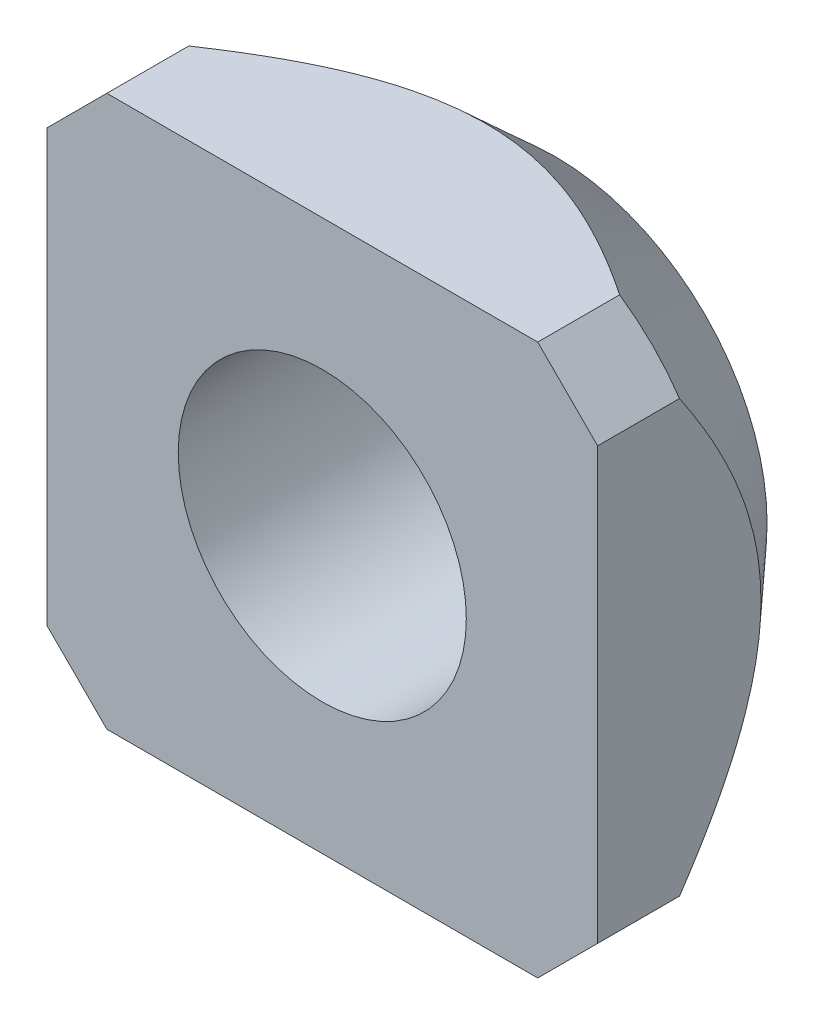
ISO-10303-21;
HEADER;
FILE_DESCRIPTION(('STEP AP214'),'2;1');
FILE_NAME('part.step','',(''),(''),'','','');
FILE_SCHEMA(('AUTOMOTIVE_DESIGN { 1 0 10303 214 1 1 1 1 }'));
ENDSEC;
DATA;
#1=APPLICATION_CONTEXT('core data for automotive mechanical design processes');
#2=APPLICATION_PROTOCOL_DEFINITION('international standard','automotive_design',2000,#1);
#3=PRODUCT_CONTEXT('',#1,'mechanical');
#4=PRODUCT('Part','Part','',(#3));
#5=PRODUCT_RELATED_PRODUCT_CATEGORY('part','',(#4));
#6=PRODUCT_DEFINITION_FORMATION('','',#4);
#7=PRODUCT_DEFINITION_CONTEXT('part definition',#1,'design');
#8=PRODUCT_DEFINITION('design','',#6,#7);
#9=PRODUCT_DEFINITION_SHAPE('','',#8);
#10=(LENGTH_UNIT() NAMED_UNIT(*) SI_UNIT(.MILLI.,.METRE.));
#11=(NAMED_UNIT(*) PLANE_ANGLE_UNIT() SI_UNIT($,.RADIAN.));
#12=(NAMED_UNIT(*) SI_UNIT($,.STERADIAN.) SOLID_ANGLE_UNIT());
#13=UNCERTAINTY_MEASURE_WITH_UNIT(LENGTH_MEASURE(1.E-05),#10,'distance_accuracy_value','');
#14=(GEOMETRIC_REPRESENTATION_CONTEXT(3) GLOBAL_UNCERTAINTY_ASSIGNED_CONTEXT((#13)) GLOBAL_UNIT_ASSIGNED_CONTEXT((#10,
#11,#12)) REPRESENTATION_CONTEXT('',''));
#15=CARTESIAN_POINT('',(0.,0.,0.));
#16=DIRECTION('',(0.,0.,1.));
#17=DIRECTION('',(1.,0.,0.));
#18=AXIS2_PLACEMENT_3D('',#15,#16,#17);
#19=CARTESIAN_POINT('',(0.,0.,-5.5));
#20=DIRECTION('',(0.,0.,1.));
#21=DIRECTION('',(1.,0.,0.));
#22=AXIS2_PLACEMENT_3D('',#19,#20,#21);
#23=PLANE('',#22);
#24=CARTESIAN_POINT('',(0.,0.,-5.5));
#25=DIRECTION('',(0.,0.,1.));
#26=DIRECTION('',(1.,0.,0.));
#27=AXIS2_PLACEMENT_3D('',#24,#25,#26);
#28=CIRCLE('',#27,3.4);
#29=CARTESIAN_POINT('',(3.4,0.,-5.5));
#30=VERTEX_POINT('',#29);
#31=EDGE_CURVE('E248',#30,#30,#28,.T.);
#32=ORIENTED_EDGE('',*,*,#31,.T.);
#33=EDGE_LOOP('',(#32));
#34=FACE_BOUND('',#33,.T.);
#35=CARTESIAN_POINT('',(0.,0.,-5.50000000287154));
#36=DIRECTION('',(0.,0.,1.));
#37=DIRECTION('',(1.,0.,0.));
#38=AXIS2_PLACEMENT_3D('',#35,#36,#37);
#39=CIRCLE('',#38,5.00000000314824);
#40=CARTESIAN_POINT('',(5.00000000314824,0.,-5.50000000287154));
#41=VERTEX_POINT('',#40);
#42=EDGE_CURVE('E35',#41,#41,#39,.T.);
#43=ORIENTED_EDGE('',*,*,#42,.F.);
#44=EDGE_LOOP('',(#43));
#45=FACE_BOUND('',#44,.T.);
#46=ADVANCED_FACE('F32',(#34,#45),#23,.F.);
#47=CARTESIAN_POINT('',(0.,0.,-1.91193420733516));
#48=DIRECTION('',(0.,0.,1.));
#49=DIRECTION('',(1.,0.,0.));
#50=AXIS2_PLACEMENT_3D('',#47,#48,#49);
#51=CONICAL_SURFACE('',#50,8.27271392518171,0.739466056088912);
#52=ORIENTED_EDGE('',*,*,#42,.T.);
#53=EDGE_LOOP('',(#52));
#54=FACE_BOUND('',#53,.T.);
#55=CARTESIAN_POINT('',(-6.49999999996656,5.08578643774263,-1.93333420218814));
#56=CARTESIAN_POINT('',(-6.49999999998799,4.97217656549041,-2.01007902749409));
#57=CARTESIAN_POINT('',(-6.49999999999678,4.85782950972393,-2.08574579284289));
#58=CARTESIAN_POINT('',(-6.50000000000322,4.62749756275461,-2.23459577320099));
#59=CARTESIAN_POINT('',(-6.50000000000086,4.51151233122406,-2.30777846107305));
#60=CARTESIAN_POINT('',(-6.49999999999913,4.27735001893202,-2.45156937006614));
#61=CARTESIAN_POINT('',(-6.49999999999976,4.15916634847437,-2.52216690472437));
#62=CARTESIAN_POINT('',(-6.50000000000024,3.92090179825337,-2.66006146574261));
#63=CARTESIAN_POINT('',(-6.50000000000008,3.80082102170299,-2.72735867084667));
#64=CARTESIAN_POINT('',(-6.49999999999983,3.43117049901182,-2.927024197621));
#65=CARTESIAN_POINT('',(-6.49999999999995,3.17828163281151,-3.05336340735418));
#66=CARTESIAN_POINT('',(-6.50000000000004,2.66320472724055,-3.2847897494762));
#67=CARTESIAN_POINT('',(-6.50000000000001,2.40103115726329,-3.38990837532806));
#68=CARTESIAN_POINT('',(-6.49999999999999,1.96194937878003,-3.54007016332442));
#69=CARTESIAN_POINT('',(-6.5,1.78780916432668,-3.5931930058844));
#70=CARTESIAN_POINT('',(-6.5,1.43593803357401,-3.68604206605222));
#71=CARTESIAN_POINT('',(-6.5,1.25820705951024,-3.72576806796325));
#72=CARTESIAN_POINT('',(-6.5,0.901971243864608,-3.78972854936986));
#73=CARTESIAN_POINT('',(-6.5,0.723496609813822,-3.81412921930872));
#74=CARTESIAN_POINT('',(-6.5,0.365074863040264,-3.84691624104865));
#75=CARTESIAN_POINT('',(-6.5,0.185127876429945,-3.85530395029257));
#76=CARTESIAN_POINT('',(-6.5,-0.175331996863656,-3.85561829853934));
#77=CARTESIAN_POINT('',(-6.5,-0.355844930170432,-3.84749448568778));
#78=CARTESIAN_POINT('',(-6.5,-0.715412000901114,-3.81512247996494));
#79=CARTESIAN_POINT('',(-6.5,-0.894466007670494,-3.79087285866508));
#80=CARTESIAN_POINT('',(-6.5,-1.25186987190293,-3.72710369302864));
#81=CARTESIAN_POINT('',(-6.5,-1.43018938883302,-3.6874161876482));
#82=CARTESIAN_POINT('',(-6.5,-1.7832209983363,-3.59454247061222));
#83=CARTESIAN_POINT('',(-6.5,-1.95793314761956,-3.54135647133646));
#84=CARTESIAN_POINT('',(-6.5,-2.39791270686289,-3.39110767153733));
#85=CARTESIAN_POINT('',(-6.5,-2.66041462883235,-3.2859613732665));
#86=CARTESIAN_POINT('',(-6.5,-3.17612601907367,-3.05441341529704));
#87=CARTESIAN_POINT('',(-6.5,-3.4293209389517,-2.92798006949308));
#88=CARTESIAN_POINT('',(-6.5,-3.79940591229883,-2.72814379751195));
#89=CARTESIAN_POINT('',(-6.5,-3.91962359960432,-2.66078705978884));
#90=CARTESIAN_POINT('',(-6.5,-4.15815744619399,-2.52276484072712));
#91=CARTESIAN_POINT('',(-6.5,-4.27647350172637,-2.45209917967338));
#92=CARTESIAN_POINT('',(-6.5,-4.510894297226,-2.30816632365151));
#93=CARTESIAN_POINT('',(-6.5,-4.62700566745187,-2.23490988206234));
#94=CARTESIAN_POINT('',(-6.5,-4.85758619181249,-2.08590677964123));
#95=CARTESIAN_POINT('',(-6.5,-4.97205568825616,-2.01016064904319));
#96=CARTESIAN_POINT('',(-6.5,-5.08578643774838,-1.93333420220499));
#97=B_SPLINE_CURVE_WITH_KNOTS('',3,(#55,#56,#57,#58,#59,#60,#61,#62,#63,#64,#65,#66,#67,#68,#69,
#70,#71,#72,#73,#74,#75,#76,#77,#78,#79,#80,#81,#82,#83,#84,#85,#86,#87,#88,#89,#90,#91,#92,#93,
#94,#95,#96),.UNSPECIFIED.,.F.,.F.,(4,2,2,2,2,2,2,2,2,2,2,2,2,2,2,2,2,2,2,2,4),(0.,
0.41131042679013,0.822707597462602,1.23564791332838,1.64856583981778,2.49590493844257,
3.34197710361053,3.88772071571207,4.43347311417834,4.97320018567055,5.51288150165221,
6.05421432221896,6.59559510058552,7.1430386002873,7.69047348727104,8.53748456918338,
9.38576777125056,9.79913116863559,10.2125170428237,10.6243522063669,11.0361002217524),.UNSPECIFIED.);
#98=CARTESIAN_POINT('',(-6.50000000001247,5.08578643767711,-1.93333420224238));
#99=VERTEX_POINT('',#98);
#100=CARTESIAN_POINT('',(-6.50000000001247,-5.08578643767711,-1.93333420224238));
#101=VERTEX_POINT('',#100);
#102=EDGE_CURVE('E161',#99,#101,#97,.T.);
#103=ORIENTED_EDGE('',*,*,#102,.F.);
#104=CARTESIAN_POINT('',(-5.08578643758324,6.50000000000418,-1.93333420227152));
#105=CARTESIAN_POINT('',(-5.20320338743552,6.38258305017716,-1.95544496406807));
#106=CARTESIAN_POINT('',(-5.32114245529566,6.26464398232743,-1.97213629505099));
#107=CARTESIAN_POINT('',(-5.55702028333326,6.02876615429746,-1.99438943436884));
#108=CARTESIAN_POINT('',(-5.6749567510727,5.9108296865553,-2.00000000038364));
#109=CARTESIAN_POINT('',(-5.91082968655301,5.67495675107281,-2.00000000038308));
#110=CARTESIAN_POINT('',(-6.02876615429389,5.55702028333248,-1.99438943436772));
#111=CARTESIAN_POINT('',(-6.2646439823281,5.32114245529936,-1.97213629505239));
#112=CARTESIAN_POINT('',(-6.38258305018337,5.20320338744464,-1.95544496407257));
#113=CARTESIAN_POINT('',(-6.50000000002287,5.08578643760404,-1.93333420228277));
#114=B_SPLINE_CURVE_WITH_KNOTS('',3,(#104,#105,#106,#107,#108,#109,#110,#111,#112,#113),
.UNSPECIFIED.,.F.,.F.,(4,2,2,2,4),(0.,0.502492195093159,1.00276834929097,1.50304450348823,
2.00553669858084),.UNSPECIFIED.);
#115=CARTESIAN_POINT('',(-5.08578643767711,6.50000000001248,-1.93333420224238));
#116=VERTEX_POINT('',#115);
#117=EDGE_CURVE('E167',#116,#99,#114,.T.);
#118=ORIENTED_EDGE('',*,*,#117,.F.);
#119=CARTESIAN_POINT('',(5.08578643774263,6.49999999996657,-1.93333420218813));
#120=CARTESIAN_POINT('',(4.9721765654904,6.49999999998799,-2.01007902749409));
#121=CARTESIAN_POINT('',(4.85782950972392,6.49999999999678,-2.08574579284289));
#122=CARTESIAN_POINT('',(4.62749756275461,6.50000000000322,-2.23459577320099));
#123=CARTESIAN_POINT('',(4.51151233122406,6.50000000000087,-2.30777846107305));
#124=CARTESIAN_POINT('',(4.27735001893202,6.49999999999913,-2.45156937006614));
#125=CARTESIAN_POINT('',(4.15916634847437,6.49999999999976,-2.52216690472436));
#126=CARTESIAN_POINT('',(3.92090179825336,6.50000000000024,-2.66006146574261));
#127=CARTESIAN_POINT('',(3.80082102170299,6.50000000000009,-2.72735867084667));
#128=CARTESIAN_POINT('',(3.43117049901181,6.49999999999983,-2.927024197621));
#129=CARTESIAN_POINT('',(3.17828163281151,6.49999999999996,-3.05336340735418));
#130=CARTESIAN_POINT('',(2.66320472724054,6.50000000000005,-3.2847897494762));
#131=CARTESIAN_POINT('',(2.40103115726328,6.50000000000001,-3.38990837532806));
#132=CARTESIAN_POINT('',(1.96194937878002,6.5,-3.54007016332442));
#133=CARTESIAN_POINT('',(1.78780916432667,6.5,-3.5931930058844));
#134=CARTESIAN_POINT('',(1.435938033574,6.50000000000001,-3.68604206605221));
#135=CARTESIAN_POINT('',(1.25820705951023,6.5,-3.72576806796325));
#136=CARTESIAN_POINT('',(0.901971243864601,6.5,-3.78972854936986));
#137=CARTESIAN_POINT('',(0.723496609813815,6.5,-3.81412921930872));
#138=CARTESIAN_POINT('',(0.365074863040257,6.5,-3.84691624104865));
#139=CARTESIAN_POINT('',(0.185127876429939,6.5,-3.85530395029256));
#140=CARTESIAN_POINT('',(-0.175331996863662,6.5,-3.85561829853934));
#141=CARTESIAN_POINT('',(-0.355844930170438,6.5,-3.84749448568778));
#142=CARTESIAN_POINT('',(-0.715412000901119,6.5,-3.81512247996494));
#143=CARTESIAN_POINT('',(-0.8944660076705,6.5,-3.79087285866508));
#144=CARTESIAN_POINT('',(-1.25186987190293,6.5,-3.72710369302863));
#145=CARTESIAN_POINT('',(-1.43018938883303,6.5,-3.68741618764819));
#146=CARTESIAN_POINT('',(-1.7832209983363,6.5,-3.59454247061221));
#147=CARTESIAN_POINT('',(-1.95793314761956,6.5,-3.54135647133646));
#148=CARTESIAN_POINT('',(-2.3979127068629,6.5,-3.39110767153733));
#149=CARTESIAN_POINT('',(-2.66041462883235,6.5,-3.2859613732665));
#150=CARTESIAN_POINT('',(-3.17612601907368,6.5,-3.05441341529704));
#151=CARTESIAN_POINT('',(-3.4293209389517,6.5,-2.92798006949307));
#152=CARTESIAN_POINT('',(-3.79940591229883,6.5,-2.72814379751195));
#153=CARTESIAN_POINT('',(-3.91962359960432,6.5,-2.66078705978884));
#154=CARTESIAN_POINT('',(-4.15815744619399,6.5,-2.52276484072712));
#155=CARTESIAN_POINT('',(-4.27647350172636,6.5,-2.45209917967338));
#156=CARTESIAN_POINT('',(-4.510894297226,6.5,-2.30816632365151));
#157=CARTESIAN_POINT('',(-4.62700566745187,6.5,-2.23490988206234));
#158=CARTESIAN_POINT('',(-4.85758619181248,6.5,-2.08590677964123));
#159=CARTESIAN_POINT('',(-4.97205568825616,6.5,-2.01016064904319));
#160=CARTESIAN_POINT('',(-5.08578643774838,6.5,-1.93333420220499));
#161=B_SPLINE_CURVE_WITH_KNOTS('',3,(#119,#120,#121,#122,#123,#124,#125,#126,#127,#128,#129,
#130,#131,#132,#133,#134,#135,#136,#137,#138,#139,#140,#141,#142,#143,#144,#145,#146,#147,#148,
#149,#150,#151,#152,#153,#154,#155,#156,#157,#158,#159,#160),.UNSPECIFIED.,.F.,.F.,(4,2,2,2,2,2,
2,2,2,2,2,2,2,2,2,2,2,2,2,2,4),(0.,0.411310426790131,0.822707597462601,1.23564791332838,
1.64856583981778,2.49590493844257,3.34197710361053,3.88772071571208,4.43347311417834,
4.97320018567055,5.51288150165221,6.05421432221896,6.59559510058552,7.1430386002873,
7.69047348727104,8.53748456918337,9.38576777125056,9.79913116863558,10.2125170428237,
10.6243522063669,11.0361002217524),.UNSPECIFIED.);
#162=CARTESIAN_POINT('',(5.08578643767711,6.50000000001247,-1.93333420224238));
#163=VERTEX_POINT('',#162);
#164=EDGE_CURVE('E101',#163,#116,#161,.T.);
#165=ORIENTED_EDGE('',*,*,#164,.F.);
#166=CARTESIAN_POINT('',(6.50000000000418,5.08578643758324,-1.93333420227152));
#167=CARTESIAN_POINT('',(6.38258305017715,5.20320338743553,-1.95544496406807));
#168=CARTESIAN_POINT('',(6.26464398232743,5.32114245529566,-1.97213629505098));
#169=CARTESIAN_POINT('',(6.02876615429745,5.55702028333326,-1.99438943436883));
#170=CARTESIAN_POINT('',(5.9108296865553,5.6749567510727,-2.00000000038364));
#171=CARTESIAN_POINT('',(5.67495675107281,5.91082968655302,-2.00000000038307));
#172=CARTESIAN_POINT('',(5.55702028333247,6.02876615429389,-1.99438943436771));
#173=CARTESIAN_POINT('',(5.32114245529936,6.2646439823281,-1.97213629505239));
#174=CARTESIAN_POINT('',(5.20320338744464,6.38258305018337,-1.95544496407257));
#175=CARTESIAN_POINT('',(5.08578643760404,6.50000000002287,-1.93333420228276));
#176=B_SPLINE_CURVE_WITH_KNOTS('',3,(#166,#167,#168,#169,#170,#171,#172,#173,#174,#175),
.UNSPECIFIED.,.F.,.F.,(4,2,2,2,4),(0.,0.502492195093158,1.00276834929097,1.50304450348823,
2.00553669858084),.UNSPECIFIED.);
#177=CARTESIAN_POINT('',(6.50000000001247,5.08578643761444,-1.93333420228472));
#178=VERTEX_POINT('',#177);
#179=EDGE_CURVE('E95',#178,#163,#176,.T.);
#180=ORIENTED_EDGE('',*,*,#179,.F.);
#181=CARTESIAN_POINT('',(6.49999999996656,-5.08578643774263,-1.93333420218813));
#182=CARTESIAN_POINT('',(6.49999999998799,-4.97217656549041,-2.01007902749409));
#183=CARTESIAN_POINT('',(6.49999999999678,-4.85782950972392,-2.08574579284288));
#184=CARTESIAN_POINT('',(6.50000000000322,-4.62749756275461,-2.23459577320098));
#185=CARTESIAN_POINT('',(6.50000000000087,-4.51151233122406,-2.30777846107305));
#186=CARTESIAN_POINT('',(6.49999999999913,-4.27735001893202,-2.45156937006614));
#187=CARTESIAN_POINT('',(6.49999999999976,-4.15916634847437,-2.52216690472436));
#188=CARTESIAN_POINT('',(6.50000000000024,-3.92090179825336,-2.6600614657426));
#189=CARTESIAN_POINT('',(6.50000000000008,-3.80082102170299,-2.72735867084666));
#190=CARTESIAN_POINT('',(6.49999999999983,-3.43117049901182,-2.927024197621));
#191=CARTESIAN_POINT('',(6.49999999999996,-3.17828163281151,-3.05336340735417));
#192=CARTESIAN_POINT('',(6.50000000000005,-2.66320472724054,-3.2847897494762));
#193=CARTESIAN_POINT('',(6.50000000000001,-2.40103115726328,-3.38990837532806));
#194=CARTESIAN_POINT('',(6.49999999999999,-1.96194937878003,-3.54007016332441));
#195=CARTESIAN_POINT('',(6.5,-1.78780916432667,-3.5931930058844));
#196=CARTESIAN_POINT('',(6.5,-1.435938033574,-3.68604206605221));
#197=CARTESIAN_POINT('',(6.5,-1.25820705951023,-3.72576806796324));
#198=CARTESIAN_POINT('',(6.5,-0.901971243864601,-3.78972854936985));
#199=CARTESIAN_POINT('',(6.5,-0.723496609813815,-3.81412921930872));
#200=CARTESIAN_POINT('',(6.5,-0.365074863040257,-3.84691624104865));
#201=CARTESIAN_POINT('',(6.5,-0.185127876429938,-3.85530395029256));
#202=CARTESIAN_POINT('',(6.5,0.175331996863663,-3.85561829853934));
#203=CARTESIAN_POINT('',(6.5,0.355844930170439,-3.84749448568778));
#204=CARTESIAN_POINT('',(6.5,0.715412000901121,-3.81512247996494));
#205=CARTESIAN_POINT('',(6.5,0.894466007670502,-3.79087285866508));
#206=CARTESIAN_POINT('',(6.5,1.25186987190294,-3.72710369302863));
#207=CARTESIAN_POINT('',(6.5,1.43018938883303,-3.68741618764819));
#208=CARTESIAN_POINT('',(6.5,1.7832209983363,-3.59454247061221));
#209=CARTESIAN_POINT('',(6.5,1.95793314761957,-3.54135647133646));
#210=CARTESIAN_POINT('',(6.5,2.3979127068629,-3.39110767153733));
#211=CARTESIAN_POINT('',(6.5,2.66041462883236,-3.2859613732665));
#212=CARTESIAN_POINT('',(6.5,3.17612601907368,-3.05441341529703));
#213=CARTESIAN_POINT('',(6.5,3.42932093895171,-2.92798006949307));
#214=CARTESIAN_POINT('',(6.5,3.79940591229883,-2.72814379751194));
#215=CARTESIAN_POINT('',(6.5,3.91962359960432,-2.66078705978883));
#216=CARTESIAN_POINT('',(6.5,4.15815744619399,-2.52276484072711));
#217=CARTESIAN_POINT('',(6.5,4.27647350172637,-2.45209917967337));
#218=CARTESIAN_POINT('',(6.5,4.51089429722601,-2.30816632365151));
#219=CARTESIAN_POINT('',(6.5,4.62700566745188,-2.23490988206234));
#220=CARTESIAN_POINT('',(6.5,4.85758619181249,-2.08590677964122));
#221=CARTESIAN_POINT('',(6.5,4.97205568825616,-2.01016064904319));
#222=CARTESIAN_POINT('',(6.5,5.08578643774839,-1.93333420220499));
#223=B_SPLINE_CURVE_WITH_KNOTS('',3,(#181,#182,#183,#184,#185,#186,#187,#188,#189,#190,#191,
#192,#193,#194,#195,#196,#197,#198,#199,#200,#201,#202,#203,#204,#205,#206,#207,#208,#209,#210,
#211,#212,#213,#214,#215,#216,#217,#218,#219,#220,#221,#222),.UNSPECIFIED.,.F.,.F.,(4,2,2,2,2,2,
2,2,2,2,2,2,2,2,2,2,2,2,2,2,4),(0.,0.411310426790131,0.822707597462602,1.23564791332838,
1.64856583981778,2.49590493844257,3.34197710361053,3.88772071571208,4.43347311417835,
4.97320018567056,5.51288150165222,6.05421432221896,6.59559510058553,7.14303860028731,
7.69047348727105,8.53748456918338,9.38576777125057,9.79913116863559,10.2125170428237,
10.6243522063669,11.0361002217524),.UNSPECIFIED.);
#224=CARTESIAN_POINT('',(6.50000000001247,-5.08578643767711,-1.93333420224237));
#225=VERTEX_POINT('',#224);
#226=EDGE_CURVE('E99',#225,#178,#223,.T.);
#227=ORIENTED_EDGE('',*,*,#226,.F.);
#228=CARTESIAN_POINT('',(5.08578643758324,-6.50000000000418,-1.93333420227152));
#229=CARTESIAN_POINT('',(5.20320338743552,-6.38258305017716,-1.95544496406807));
#230=CARTESIAN_POINT('',(5.32114245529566,-6.26464398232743,-1.97213629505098));
#231=CARTESIAN_POINT('',(5.55702028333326,-6.02876615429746,-1.99438943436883));
#232=CARTESIAN_POINT('',(5.6749567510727,-5.9108296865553,-2.00000000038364));
#233=CARTESIAN_POINT('',(5.91082968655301,-5.67495675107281,-2.00000000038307));
#234=CARTESIAN_POINT('',(6.02876615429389,-5.55702028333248,-1.99438943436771));
#235=CARTESIAN_POINT('',(6.2646439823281,-5.32114245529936,-1.97213629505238));
#236=CARTESIAN_POINT('',(6.38258305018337,-5.20320338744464,-1.95544496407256));
#237=CARTESIAN_POINT('',(6.50000000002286,-5.08578643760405,-1.93333420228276));
#238=B_SPLINE_CURVE_WITH_KNOTS('',3,(#228,#229,#230,#231,#232,#233,#234,#235,#236,#237),
.UNSPECIFIED.,.F.,.F.,(4,2,2,2,4),(0.,0.502492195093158,1.00276834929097,1.50304450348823,
2.00553669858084),.UNSPECIFIED.);
#239=CARTESIAN_POINT('',(5.08578643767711,-6.50000000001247,-1.93333420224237));
#240=VERTEX_POINT('',#239);
#241=EDGE_CURVE('E115',#240,#225,#238,.T.);
#242=ORIENTED_EDGE('',*,*,#241,.F.);
#243=CARTESIAN_POINT('',(-5.08578643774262,-6.49999999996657,-1.93333420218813));
#244=CARTESIAN_POINT('',(-4.9721765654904,-6.49999999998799,-2.01007902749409));
#245=CARTESIAN_POINT('',(-4.85782950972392,-6.49999999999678,-2.08574579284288));
#246=CARTESIAN_POINT('',(-4.62749756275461,-6.50000000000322,-2.23459577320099));
#247=CARTESIAN_POINT('',(-4.51151233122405,-6.50000000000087,-2.30777846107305));
#248=CARTESIAN_POINT('',(-4.27735001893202,-6.49999999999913,-2.45156937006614));
#249=CARTESIAN_POINT('',(-4.15916634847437,-6.49999999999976,-2.52216690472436));
#250=CARTESIAN_POINT('',(-3.92090179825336,-6.50000000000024,-2.6600614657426));
#251=CARTESIAN_POINT('',(-3.80082102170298,-6.50000000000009,-2.72735867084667));
#252=CARTESIAN_POINT('',(-3.43117049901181,-6.49999999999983,-2.927024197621));
#253=CARTESIAN_POINT('',(-3.1782816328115,-6.49999999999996,-3.05336340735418));
#254=CARTESIAN_POINT('',(-2.66320472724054,-6.50000000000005,-3.2847897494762));
#255=CARTESIAN_POINT('',(-2.40103115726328,-6.50000000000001,-3.38990837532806));
#256=CARTESIAN_POINT('',(-1.96194937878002,-6.5,-3.54007016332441));
#257=CARTESIAN_POINT('',(-1.78780916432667,-6.5,-3.5931930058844));
#258=CARTESIAN_POINT('',(-1.435938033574,-6.5,-3.68604206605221));
#259=CARTESIAN_POINT('',(-1.25820705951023,-6.5,-3.72576806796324));
#260=CARTESIAN_POINT('',(-0.9019712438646,-6.5,-3.78972854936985));
#261=CARTESIAN_POINT('',(-0.723496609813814,-6.5,-3.81412921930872));
#262=CARTESIAN_POINT('',(-0.365074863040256,-6.5,-3.84691624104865));
#263=CARTESIAN_POINT('',(-0.185127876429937,-6.5,-3.85530395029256));
#264=CARTESIAN_POINT('',(0.175331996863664,-6.5,-3.85561829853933));
#265=CARTESIAN_POINT('',(0.35584493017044,-6.5,-3.84749448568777));
#266=CARTESIAN_POINT('',(0.715412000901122,-6.5,-3.81512247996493));
#267=CARTESIAN_POINT('',(0.894466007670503,-6.5,-3.79087285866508));
#268=CARTESIAN_POINT('',(1.25186987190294,-6.5,-3.72710369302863));
#269=CARTESIAN_POINT('',(1.43018938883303,-6.5,-3.68741618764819));
#270=CARTESIAN_POINT('',(1.7832209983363,-6.5,-3.59454247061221));
#271=CARTESIAN_POINT('',(1.95793314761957,-6.5,-3.54135647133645));
#272=CARTESIAN_POINT('',(2.3979127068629,-6.5,-3.39110767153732));
#273=CARTESIAN_POINT('',(2.66041462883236,-6.5,-3.28596137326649));
#274=CARTESIAN_POINT('',(3.17612601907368,-6.5,-3.05441341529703));
#275=CARTESIAN_POINT('',(3.42932093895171,-6.5,-2.92798006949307));
#276=CARTESIAN_POINT('',(3.79940591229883,-6.5,-2.72814379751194));
#277=CARTESIAN_POINT('',(3.91962359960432,-6.5,-2.66078705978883));
#278=CARTESIAN_POINT('',(4.15815744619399,-6.5,-2.52276484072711));
#279=CARTESIAN_POINT('',(4.27647350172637,-6.5,-2.45209917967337));
#280=CARTESIAN_POINT('',(4.510894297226,-6.5,-2.30816632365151));
#281=CARTESIAN_POINT('',(4.62700566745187,-6.5,-2.23490988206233));
#282=CARTESIAN_POINT('',(4.85758619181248,-6.5,-2.08590677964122));
#283=CARTESIAN_POINT('',(4.97205568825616,-6.5,-2.01016064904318));
#284=CARTESIAN_POINT('',(5.08578643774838,-6.5,-1.93333420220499));
#285=B_SPLINE_CURVE_WITH_KNOTS('',3,(#243,#244,#245,#246,#247,#248,#249,#250,#251,#252,#253,
#254,#255,#256,#257,#258,#259,#260,#261,#262,#263,#264,#265,#266,#267,#268,#269,#270,#271,#272,
#273,#274,#275,#276,#277,#278,#279,#280,#281,#282,#283,#284),.UNSPECIFIED.,.F.,.F.,(4,2,2,2,2,2,
2,2,2,2,2,2,2,2,2,2,2,2,2,2,4),(0.,0.411310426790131,0.822707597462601,1.23564791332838,
1.64856583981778,2.49590493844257,3.34197710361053,3.88772071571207,4.43347311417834,
4.97320018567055,5.51288150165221,6.05421432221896,6.59559510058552,7.1430386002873,
7.69047348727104,8.53748456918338,9.38576777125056,9.79913116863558,10.2125170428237,
10.6243522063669,11.0361002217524),.UNSPECIFIED.);
#286=CARTESIAN_POINT('',(-5.08578643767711,-6.50000000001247,-1.93333420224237));
#287=VERTEX_POINT('',#286);
#288=EDGE_CURVE('E148',#287,#240,#285,.T.);
#289=ORIENTED_EDGE('',*,*,#288,.F.);
#290=CARTESIAN_POINT('',(-6.50000000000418,-5.08578643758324,-1.93333420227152));
#291=CARTESIAN_POINT('',(-6.38258305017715,-5.20320338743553,-1.95544496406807));
#292=CARTESIAN_POINT('',(-6.26464398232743,-5.32114245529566,-1.97213629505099));
#293=CARTESIAN_POINT('',(-6.02876615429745,-5.55702028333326,-1.99438943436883));
#294=CARTESIAN_POINT('',(-5.9108296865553,-5.6749567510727,-2.00000000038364));
#295=CARTESIAN_POINT('',(-5.6749567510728,-5.91082968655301,-2.00000000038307));
#296=CARTESIAN_POINT('',(-5.55702028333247,-6.02876615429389,-1.99438943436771));
#297=CARTESIAN_POINT('',(-5.32114245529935,-6.2646439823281,-1.97213629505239));
#298=CARTESIAN_POINT('',(-5.20320338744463,-6.38258305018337,-1.95544496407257));
#299=CARTESIAN_POINT('',(-5.08578643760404,-6.50000000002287,-1.93333420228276));
#300=B_SPLINE_CURVE_WITH_KNOTS('',3,(#290,#291,#292,#293,#294,#295,#296,#297,#298,#299),
.UNSPECIFIED.,.F.,.F.,(4,2,2,2,4),(0.,0.50249219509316,1.00276834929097,1.50304450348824,
2.00553669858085),.UNSPECIFIED.);
#301=EDGE_CURVE('E155',#101,#287,#300,.T.);
#302=ORIENTED_EDGE('',*,*,#301,.F.);
#303=EDGE_LOOP('',(#103,#118,#165,#180,#227,#242,#289,#302));
#304=FACE_BOUND('',#303,.T.);
#305=ADVANCED_FACE('F97',(#54,#304),#51,.T.);
#306=CARTESIAN_POINT('',(6.5,5.08578643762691,0.));
#307=DIRECTION('',(0.707106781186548,0.707106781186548,0.));
#308=DIRECTION('',(-0.707106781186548,0.707106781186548,0.));
#309=AXIS2_PLACEMENT_3D('',#306,#307,#308);
#310=PLANE('',#309);
#311=DIRECTION('',(-0.707106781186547,0.707106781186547,0.));
#312=VECTOR('',#311,1.);
#313=CARTESIAN_POINT('',(6.5,5.08578643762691,0.));
#314=LINE('',#313,#312);
#315=CARTESIAN_POINT('',(6.5,5.08578643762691,0.));
#316=VERTEX_POINT('',#315);
#317=CARTESIAN_POINT('',(5.08578643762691,6.5,0.));
#318=VERTEX_POINT('',#317);
#319=EDGE_CURVE('E108',#316,#318,#314,.T.);
#320=ORIENTED_EDGE('',*,*,#319,.F.);
#321=DIRECTION('',(0.,0.,-1.));
#322=VECTOR('',#321,1.);
#323=CARTESIAN_POINT('',(6.5,5.08578643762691,0.));
#324=LINE('',#323,#322);
#325=EDGE_CURVE('E105',#178,#316,#324,.F.);
#326=ORIENTED_EDGE('',*,*,#325,.F.);
#327=ORIENTED_EDGE('',*,*,#179,.T.);
#328=DIRECTION('',(0.,0.,1.));
#329=VECTOR('',#328,1.);
#330=CARTESIAN_POINT('',(5.08578643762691,6.5,0.));
#331=LINE('',#330,#329);
#332=EDGE_CURVE('E174',#318,#163,#331,.F.);
#333=ORIENTED_EDGE('',*,*,#332,.F.);
#334=EDGE_LOOP('',(#320,#326,#327,#333));
#335=FACE_BOUND('',#334,.T.);
#336=ADVANCED_FACE('F106',(#335),#310,.T.);
#337=CARTESIAN_POINT('',(5.08578643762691,6.5,0.));
#338=DIRECTION('',(0.,1.,0.));
#339=DIRECTION('',(0.,0.,1.));
#340=AXIS2_PLACEMENT_3D('',#337,#338,#339);
#341=PLANE('',#340);
#342=DIRECTION('',(1.,0.,0.));
#343=VECTOR('',#342,1.);
#344=CARTESIAN_POINT('',(0.,6.5,0.));
#345=LINE('',#344,#343);
#346=CARTESIAN_POINT('',(-5.0857864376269,6.50000000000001,0.));
#347=VERTEX_POINT('',#346);
#348=EDGE_CURVE('E123',#318,#347,#345,.F.);
#349=ORIENTED_EDGE('',*,*,#348,.F.);
#350=ORIENTED_EDGE('',*,*,#332,.T.);
#351=ORIENTED_EDGE('',*,*,#164,.T.);
#352=DIRECTION('',(0.,0.,1.));
#353=VECTOR('',#352,1.);
#354=CARTESIAN_POINT('',(-5.0857864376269,6.50000000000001,0.));
#355=LINE('',#354,#353);
#356=EDGE_CURVE('E173',#347,#116,#355,.F.);
#357=ORIENTED_EDGE('',*,*,#356,.F.);
#358=EDGE_LOOP('',(#349,#350,#351,#357));
#359=FACE_BOUND('',#358,.T.);
#360=ADVANCED_FACE('F182',(#359),#341,.T.);
#361=CARTESIAN_POINT('',(-5.0857864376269,6.50000000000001,0.));
#362=DIRECTION('',(-0.707106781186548,0.707106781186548,0.));
#363=DIRECTION('',(-0.707106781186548,-0.707106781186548,0.));
#364=AXIS2_PLACEMENT_3D('',#361,#362,#363);
#365=PLANE('',#364);
#366=DIRECTION('',(-0.707106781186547,-0.707106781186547,0.));
#367=VECTOR('',#366,1.);
#368=CARTESIAN_POINT('',(-5.0857864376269,6.50000000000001,0.));
#369=LINE('',#368,#367);
#370=CARTESIAN_POINT('',(-6.5,5.08578643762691,0.));
#371=VERTEX_POINT('',#370);
#372=EDGE_CURVE('E221',#347,#371,#369,.T.);
#373=ORIENTED_EDGE('',*,*,#372,.F.);
#374=ORIENTED_EDGE('',*,*,#356,.T.);
#375=ORIENTED_EDGE('',*,*,#117,.T.);
#376=DIRECTION('',(0.,0.,1.));
#377=VECTOR('',#376,1.);
#378=CARTESIAN_POINT('',(-6.5,5.08578643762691,0.));
#379=LINE('',#378,#377);
#380=EDGE_CURVE('E228',#371,#99,#379,.F.);
#381=ORIENTED_EDGE('',*,*,#380,.F.);
#382=EDGE_LOOP('',(#373,#374,#375,#381));
#383=FACE_BOUND('',#382,.T.);
#384=ADVANCED_FACE('F178',(#383),#365,.T.);
#385=CARTESIAN_POINT('',(-6.5,5.08578643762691,0.));
#386=DIRECTION('',(-1.,0.,0.));
#387=DIRECTION('',(0.,0.,1.));
#388=AXIS2_PLACEMENT_3D('',#385,#386,#387);
#389=PLANE('',#388);
#390=DIRECTION('',(0.,1.,0.));
#391=VECTOR('',#390,1.);
#392=CARTESIAN_POINT('',(-6.5,0.,0.));
#393=LINE('',#392,#391);
#394=CARTESIAN_POINT('',(-6.5,-5.08578643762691,0.));
#395=VERTEX_POINT('',#394);
#396=EDGE_CURVE('E219',#371,#395,#393,.F.);
#397=ORIENTED_EDGE('',*,*,#396,.F.);
#398=ORIENTED_EDGE('',*,*,#380,.T.);
#399=ORIENTED_EDGE('',*,*,#102,.T.);
#400=DIRECTION('',(0.,0.,1.));
#401=VECTOR('',#400,1.);
#402=CARTESIAN_POINT('',(-6.5,-5.08578643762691,0.));
#403=LINE('',#402,#401);
#404=EDGE_CURVE('E234',#395,#101,#403,.F.);
#405=ORIENTED_EDGE('',*,*,#404,.F.);
#406=EDGE_LOOP('',(#397,#398,#399,#405));
#407=FACE_BOUND('',#406,.T.);
#408=ADVANCED_FACE('F181',(#407),#389,.T.);
#409=CARTESIAN_POINT('',(-6.5,-5.08578643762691,0.));
#410=DIRECTION('',(-0.707106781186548,-0.707106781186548,0.));
#411=DIRECTION('',(0.707106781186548,-0.707106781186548,0.));
#412=AXIS2_PLACEMENT_3D('',#409,#410,#411);
#413=PLANE('',#412);
#414=DIRECTION('',(0.707106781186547,-0.707106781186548,0.));
#415=VECTOR('',#414,1.);
#416=CARTESIAN_POINT('',(-6.5,-5.08578643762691,0.));
#417=LINE('',#416,#415);
#418=CARTESIAN_POINT('',(-5.08578643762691,-6.5,0.));
#419=VERTEX_POINT('',#418);
#420=EDGE_CURVE('E213',#395,#419,#417,.T.);
#421=ORIENTED_EDGE('',*,*,#420,.F.);
#422=ORIENTED_EDGE('',*,*,#404,.T.);
#423=ORIENTED_EDGE('',*,*,#301,.T.);
#424=DIRECTION('',(0.,0.,-1.));
#425=VECTOR('',#424,1.);
#426=CARTESIAN_POINT('',(-5.08578643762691,-6.5,0.));
#427=LINE('',#426,#425);
#428=EDGE_CURVE('E240',#419,#287,#427,.T.);
#429=ORIENTED_EDGE('',*,*,#428,.F.);
#430=EDGE_LOOP('',(#421,#422,#423,#429));
#431=FACE_BOUND('',#430,.T.);
#432=ADVANCED_FACE('F237',(#431),#413,.T.);
#433=CARTESIAN_POINT('',(-5.08578643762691,-6.5,0.));
#434=DIRECTION('',(0.,-1.,0.));
#435=DIRECTION('',(0.,0.,-1.));
#436=AXIS2_PLACEMENT_3D('',#433,#434,#435);
#437=PLANE('',#436);
#438=DIRECTION('',(1.,0.,0.));
#439=VECTOR('',#438,1.);
#440=CARTESIAN_POINT('',(0.,-6.5,0.));
#441=LINE('',#440,#439);
#442=CARTESIAN_POINT('',(5.08578643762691,-6.5,0.));
#443=VERTEX_POINT('',#442);
#444=EDGE_CURVE('E211',#419,#443,#441,.T.);
#445=ORIENTED_EDGE('',*,*,#444,.F.);
#446=ORIENTED_EDGE('',*,*,#428,.T.);
#447=ORIENTED_EDGE('',*,*,#288,.T.);
#448=DIRECTION('',(0.,0.,1.));
#449=VECTOR('',#448,1.);
#450=CARTESIAN_POINT('',(5.08578643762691,-6.5,0.));
#451=LINE('',#450,#449);
#452=EDGE_CURVE('E112',#443,#240,#451,.F.);
#453=ORIENTED_EDGE('',*,*,#452,.F.);
#454=EDGE_LOOP('',(#445,#446,#447,#453));
#455=FACE_BOUND('',#454,.T.);
#456=ADVANCED_FACE('F244',(#455),#437,.T.);
#457=CARTESIAN_POINT('',(5.08578643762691,-6.5,0.));
#458=DIRECTION('',(0.707106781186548,-0.707106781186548,0.));
#459=DIRECTION('',(0.707106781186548,0.707106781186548,0.));
#460=AXIS2_PLACEMENT_3D('',#457,#458,#459);
#461=PLANE('',#460);
#462=DIRECTION('',(0.707106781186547,0.707106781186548,0.));
#463=VECTOR('',#462,1.);
#464=CARTESIAN_POINT('',(5.08578643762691,-6.5,0.));
#465=LINE('',#464,#463);
#466=CARTESIAN_POINT('',(6.5,-5.08578643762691,0.));
#467=VERTEX_POINT('',#466);
#468=EDGE_CURVE('E41',#443,#467,#465,.T.);
#469=ORIENTED_EDGE('',*,*,#468,.F.);
#470=ORIENTED_EDGE('',*,*,#452,.T.);
#471=ORIENTED_EDGE('',*,*,#241,.T.);
#472=DIRECTION('',(0.,0.,-1.));
#473=VECTOR('',#472,1.);
#474=CARTESIAN_POINT('',(6.5,-5.08578643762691,0.));
#475=LINE('',#474,#473);
#476=EDGE_CURVE('E50',#467,#225,#475,.T.);
#477=ORIENTED_EDGE('',*,*,#476,.F.);
#478=EDGE_LOOP('',(#469,#470,#471,#477));
#479=FACE_BOUND('',#478,.T.);
#480=ADVANCED_FACE('F202',(#479),#461,.T.);
#481=CARTESIAN_POINT('',(6.5,-5.08578643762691,0.));
#482=DIRECTION('',(1.,0.,0.));
#483=DIRECTION('',(0.,0.,-1.));
#484=AXIS2_PLACEMENT_3D('',#481,#482,#483);
#485=PLANE('',#484);
#486=DIRECTION('',(0.,1.,0.));
#487=VECTOR('',#486,1.);
#488=CARTESIAN_POINT('',(6.5,0.,0.));
#489=LINE('',#488,#487);
#490=EDGE_CURVE('E11',#467,#316,#489,.T.);
#491=ORIENTED_EDGE('',*,*,#490,.F.);
#492=ORIENTED_EDGE('',*,*,#476,.T.);
#493=ORIENTED_EDGE('',*,*,#226,.T.);
#494=ORIENTED_EDGE('',*,*,#325,.T.);
#495=EDGE_LOOP('',(#491,#492,#493,#494));
#496=FACE_BOUND('',#495,.T.);
#497=ADVANCED_FACE('F111',(#496),#485,.T.);
#498=CARTESIAN_POINT('',(0.,0.,0.));
#499=DIRECTION('',(0.,0.,1.));
#500=DIRECTION('',(1.,0.,0.));
#501=AXIS2_PLACEMENT_3D('',#498,#499,#500);
#502=PLANE('',#501);
#503=CARTESIAN_POINT('',(0.,0.,0.));
#504=DIRECTION('',(0.,0.,1.));
#505=DIRECTION('',(1.,0.,0.));
#506=AXIS2_PLACEMENT_3D('',#503,#504,#505);
#507=CIRCLE('',#506,3.4);
#508=CARTESIAN_POINT('',(3.4,0.,0.));
#509=VERTEX_POINT('',#508);
#510=EDGE_CURVE('E206',#509,#509,#507,.T.);
#511=ORIENTED_EDGE('',*,*,#510,.F.);
#512=EDGE_LOOP('',(#511));
#513=FACE_BOUND('',#512,.T.);
#514=ORIENTED_EDGE('',*,*,#468,.T.);
#515=ORIENTED_EDGE('',*,*,#490,.T.);
#516=ORIENTED_EDGE('',*,*,#319,.T.);
#517=ORIENTED_EDGE('',*,*,#348,.T.);
#518=ORIENTED_EDGE('',*,*,#372,.T.);
#519=ORIENTED_EDGE('',*,*,#396,.T.);
#520=ORIENTED_EDGE('',*,*,#420,.T.);
#521=ORIENTED_EDGE('',*,*,#444,.T.);
#522=EDGE_LOOP('',(#514,#515,#516,#517,#518,#519,#520,#521));
#523=FACE_BOUND('',#522,.T.);
#524=ADVANCED_FACE('F192',(#513,#523),#502,.T.);
#525=CARTESIAN_POINT('',(0.,0.,0.));
#526=DIRECTION('',(0.,0.,1.));
#527=DIRECTION('',(1.,0.,0.));
#528=AXIS2_PLACEMENT_3D('',#525,#526,#527);
#529=CYLINDRICAL_SURFACE('',#528,3.4);
#530=ORIENTED_EDGE('',*,*,#510,.T.);
#531=EDGE_LOOP('',(#530));
#532=FACE_BOUND('',#531,.T.);
#533=ORIENTED_EDGE('',*,*,#31,.F.);
#534=EDGE_LOOP('',(#533));
#535=FACE_BOUND('',#534,.T.);
#536=ADVANCED_FACE('F194',(#532,#535),#529,.F.);
#537=CLOSED_SHELL('',(#46,#305,#336,#360,#384,#408,#432,#456,#480,#497,#524,#536));
#538=MANIFOLD_SOLID_BREP('B2',#537);
#539=ADVANCED_BREP_SHAPE_REPRESENTATION('',(#18,#538),#14);
#540=SHAPE_DEFINITION_REPRESENTATION(#9,#539);
ENDSEC;
END-ISO-10303-21;
